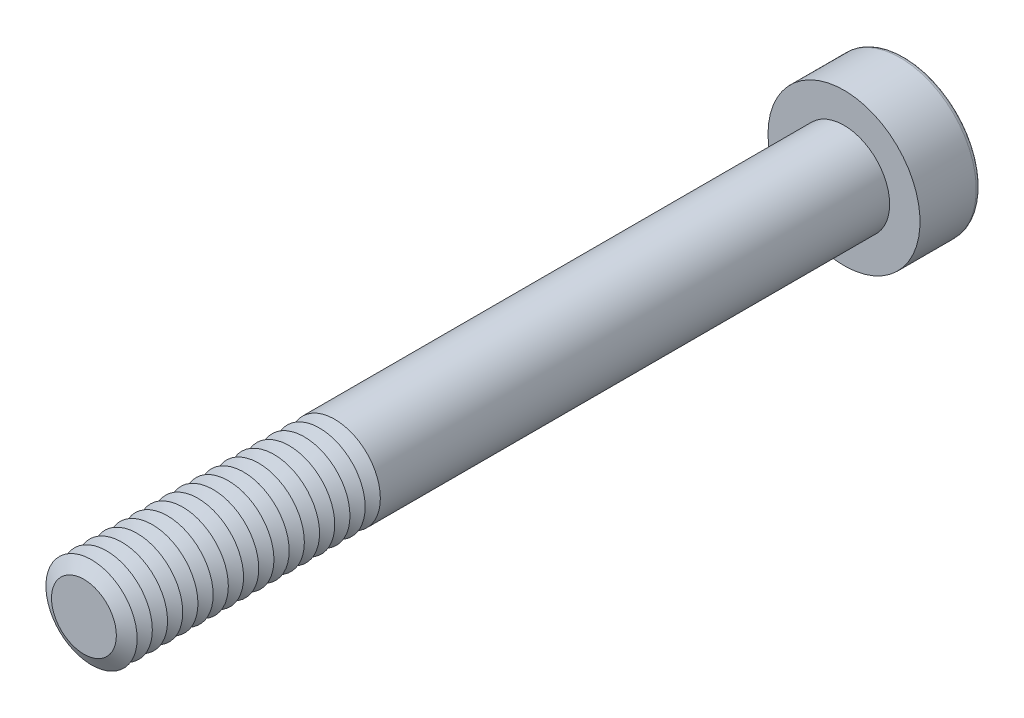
ISO-10303-21;
HEADER;
FILE_DESCRIPTION(('STEP AP214'),'2;1');
FILE_NAME('part.step','',(''),(''),'','','');
FILE_SCHEMA(('AUTOMOTIVE_DESIGN { 1 0 10303 214 1 1 1 1 }'));
ENDSEC;
DATA;
#1=APPLICATION_CONTEXT('core data for automotive mechanical design processes');
#2=APPLICATION_PROTOCOL_DEFINITION('international standard','automotive_design',2000,#1);
#3=PRODUCT_CONTEXT('',#1,'mechanical');
#4=PRODUCT('Part','Part','',(#3));
#5=PRODUCT_RELATED_PRODUCT_CATEGORY('part','',(#4));
#6=PRODUCT_DEFINITION_FORMATION('','',#4);
#7=PRODUCT_DEFINITION_CONTEXT('part definition',#1,'design');
#8=PRODUCT_DEFINITION('design','',#6,#7);
#9=PRODUCT_DEFINITION_SHAPE('','',#8);
#10=(LENGTH_UNIT() NAMED_UNIT(*) SI_UNIT(.MILLI.,.METRE.));
#11=(NAMED_UNIT(*) PLANE_ANGLE_UNIT() SI_UNIT($,.RADIAN.));
#12=(NAMED_UNIT(*) SI_UNIT($,.STERADIAN.) SOLID_ANGLE_UNIT());
#13=UNCERTAINTY_MEASURE_WITH_UNIT(LENGTH_MEASURE(1.E-05),#10,'distance_accuracy_value','');
#14=(GEOMETRIC_REPRESENTATION_CONTEXT(3) GLOBAL_UNCERTAINTY_ASSIGNED_CONTEXT((#13)) GLOBAL_UNIT_ASSIGNED_CONTEXT((#10,
#11,#12)) REPRESENTATION_CONTEXT('',''));
#15=CARTESIAN_POINT('',(0.,0.,0.));
#16=DIRECTION('',(0.,0.,1.));
#17=DIRECTION('',(1.,0.,0.));
#18=AXIS2_PLACEMENT_3D('',#15,#16,#17);
#19=CARTESIAN_POINT('',(0.,0.,46.5));
#20=DIRECTION('',(0.,0.,1.));
#21=DIRECTION('',(1.,0.,0.));
#22=AXIS2_PLACEMENT_3D('',#19,#20,#21);
#23=CONICAL_SURFACE('',#22,3.,1.0471975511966);
#24=CARTESIAN_POINT('',(0.,0.,46.));
#25=DIRECTION('',(0.,0.,1.));
#26=DIRECTION('',(1.,0.,0.));
#27=AXIS2_PLACEMENT_3D('',#24,#25,#26);
#28=CIRCLE('',#27,2.13397459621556);
#29=CARTESIAN_POINT('',(2.13397459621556,0.,46.));
#30=VERTEX_POINT('',#29);
#31=EDGE_CURVE('E314',#30,#30,#28,.T.);
#32=ORIENTED_EDGE('',*,*,#31,.T.);
#33=EDGE_LOOP('',(#32));
#34=FACE_BOUND('',#33,.T.);
#35=CARTESIAN_POINT('',(0.,0.,46.5));
#36=DIRECTION('',(0.,0.,1.));
#37=DIRECTION('',(1.,0.,0.));
#38=AXIS2_PLACEMENT_3D('',#35,#36,#37);
#39=CIRCLE('',#38,3.);
#40=CARTESIAN_POINT('',(3.,0.,46.5));
#41=VERTEX_POINT('',#40);
#42=EDGE_CURVE('E317',#41,#41,#39,.T.);
#43=ORIENTED_EDGE('',*,*,#42,.F.);
#44=EDGE_LOOP('',(#43));
#45=FACE_BOUND('',#44,.T.);
#46=ADVANCED_FACE('F39',(#34,#45),#23,.T.);
#47=CARTESIAN_POINT('',(0.,0.,46.));
#48=DIRECTION('',(0.,0.,-1.));
#49=DIRECTION('',(-1.,0.,0.));
#50=AXIS2_PLACEMENT_3D('',#47,#48,#49);
#51=CONICAL_SURFACE('',#50,2.13397459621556,1.0471975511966);
#52=CARTESIAN_POINT('',(0.,0.,45.5));
#53=DIRECTION('',(0.,0.,1.));
#54=DIRECTION('',(1.,0.,0.));
#55=AXIS2_PLACEMENT_3D('',#52,#53,#54);
#56=CIRCLE('',#55,3.);
#57=CARTESIAN_POINT('',(3.,0.,45.5));
#58=VERTEX_POINT('',#57);
#59=EDGE_CURVE('E325',#58,#58,#56,.T.);
#60=ORIENTED_EDGE('',*,*,#59,.T.);
#61=EDGE_LOOP('',(#60));
#62=FACE_BOUND('',#61,.T.);
#63=ORIENTED_EDGE('',*,*,#31,.F.);
#64=EDGE_LOOP('',(#63));
#65=FACE_BOUND('',#64,.T.);
#66=ADVANCED_FACE('F245',(#62,#65),#51,.T.);
#67=CARTESIAN_POINT('',(0.,0.,50.));
#68=DIRECTION('',(0.,0.,1.));
#69=DIRECTION('',(1.,0.,0.));
#70=AXIS2_PLACEMENT_3D('',#67,#68,#69);
#71=PLANE('',#70);
#72=CARTESIAN_POINT('',(0.,0.,50.));
#73=DIRECTION('',(0.,0.,1.));
#74=DIRECTION('',(1.,0.,0.));
#75=AXIS2_PLACEMENT_3D('',#72,#73,#74);
#76=CIRCLE('',#75,2.13397459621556);
#77=CARTESIAN_POINT('',(2.13397459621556,0.,50.));
#78=VERTEX_POINT('',#77);
#79=EDGE_CURVE('E174',#78,#78,#76,.T.);
#80=ORIENTED_EDGE('',*,*,#79,.T.);
#81=EDGE_LOOP('',(#80));
#82=FACE_BOUND('',#81,.T.);
#83=ADVANCED_FACE('F251',(#82),#71,.T.);
#84=CARTESIAN_POINT('',(0.,0.,50.));
#85=DIRECTION('',(0.,0.,-1.));
#86=DIRECTION('',(-1.,0.,0.));
#87=AXIS2_PLACEMENT_3D('',#84,#85,#86);
#88=CONICAL_SURFACE('',#87,2.13397459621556,1.0471975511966);
#89=CARTESIAN_POINT('',(0.,0.,49.5));
#90=DIRECTION('',(0.,0.,1.));
#91=DIRECTION('',(1.,0.,0.));
#92=AXIS2_PLACEMENT_3D('',#89,#90,#91);
#93=CIRCLE('',#92,3.);
#94=CARTESIAN_POINT('',(3.,0.,49.5));
#95=VERTEX_POINT('',#94);
#96=EDGE_CURVE('E291',#95,#95,#93,.T.);
#97=ORIENTED_EDGE('',*,*,#96,.T.);
#98=EDGE_LOOP('',(#97));
#99=FACE_BOUND('',#98,.T.);
#100=ORIENTED_EDGE('',*,*,#79,.F.);
#101=EDGE_LOOP('',(#100));
#102=FACE_BOUND('',#101,.T.);
#103=ADVANCED_FACE('F199',(#99,#102),#88,.T.);
#104=CARTESIAN_POINT('',(0.,0.,49.5));
#105=DIRECTION('',(0.,0.,1.));
#106=DIRECTION('',(1.,0.,0.));
#107=AXIS2_PLACEMENT_3D('',#104,#105,#106);
#108=CONICAL_SURFACE('',#107,3.,1.0471975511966);
#109=CARTESIAN_POINT('',(0.,0.,49.));
#110=DIRECTION('',(0.,0.,1.));
#111=DIRECTION('',(1.,0.,0.));
#112=AXIS2_PLACEMENT_3D('',#109,#110,#111);
#113=CIRCLE('',#112,2.13397459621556);
#114=CARTESIAN_POINT('',(2.13397459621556,0.,49.));
#115=VERTEX_POINT('',#114);
#116=EDGE_CURVE('E288',#115,#115,#113,.T.);
#117=ORIENTED_EDGE('',*,*,#116,.T.);
#118=EDGE_LOOP('',(#117));
#119=FACE_BOUND('',#118,.T.);
#120=ORIENTED_EDGE('',*,*,#96,.F.);
#121=EDGE_LOOP('',(#120));
#122=FACE_BOUND('',#121,.T.);
#123=ADVANCED_FACE('F277',(#119,#122),#108,.T.);
#124=CARTESIAN_POINT('',(0.,0.,49.));
#125=DIRECTION('',(0.,0.,-1.));
#126=DIRECTION('',(-1.,0.,0.));
#127=AXIS2_PLACEMENT_3D('',#124,#125,#126);
#128=CONICAL_SURFACE('',#127,2.13397459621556,1.0471975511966);
#129=CARTESIAN_POINT('',(0.,0.,48.5));
#130=DIRECTION('',(0.,0.,1.));
#131=DIRECTION('',(1.,0.,0.));
#132=AXIS2_PLACEMENT_3D('',#129,#130,#131);
#133=CIRCLE('',#132,3.);
#134=CARTESIAN_POINT('',(3.,0.,48.5));
#135=VERTEX_POINT('',#134);
#136=EDGE_CURVE('E300',#135,#135,#133,.T.);
#137=ORIENTED_EDGE('',*,*,#136,.T.);
#138=EDGE_LOOP('',(#137));
#139=FACE_BOUND('',#138,.T.);
#140=ORIENTED_EDGE('',*,*,#116,.F.);
#141=EDGE_LOOP('',(#140));
#142=FACE_BOUND('',#141,.T.);
#143=ADVANCED_FACE('F274',(#139,#142),#128,.T.);
#144=CARTESIAN_POINT('',(0.,0.,48.5));
#145=DIRECTION('',(0.,0.,1.));
#146=DIRECTION('',(1.,0.,0.));
#147=AXIS2_PLACEMENT_3D('',#144,#145,#146);
#148=CONICAL_SURFACE('',#147,3.,1.0471975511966);
#149=CARTESIAN_POINT('',(0.,0.,48.));
#150=DIRECTION('',(0.,0.,1.));
#151=DIRECTION('',(1.,0.,0.));
#152=AXIS2_PLACEMENT_3D('',#149,#150,#151);
#153=CIRCLE('',#152,2.13397459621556);
#154=CARTESIAN_POINT('',(2.13397459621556,0.,48.));
#155=VERTEX_POINT('',#154);
#156=EDGE_CURVE('E293',#155,#155,#153,.T.);
#157=ORIENTED_EDGE('',*,*,#156,.T.);
#158=EDGE_LOOP('',(#157));
#159=FACE_BOUND('',#158,.T.);
#160=ORIENTED_EDGE('',*,*,#136,.F.);
#161=EDGE_LOOP('',(#160));
#162=FACE_BOUND('',#161,.T.);
#163=ADVANCED_FACE('F270',(#159,#162),#148,.T.);
#164=CARTESIAN_POINT('',(0.,0.,48.));
#165=DIRECTION('',(0.,0.,-1.));
#166=DIRECTION('',(-1.,0.,0.));
#167=AXIS2_PLACEMENT_3D('',#164,#165,#166);
#168=CONICAL_SURFACE('',#167,2.13397459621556,1.0471975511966);
#169=CARTESIAN_POINT('',(0.,0.,47.5));
#170=DIRECTION('',(0.,0.,1.));
#171=DIRECTION('',(1.,0.,0.));
#172=AXIS2_PLACEMENT_3D('',#169,#170,#171);
#173=CIRCLE('',#172,3.);
#174=CARTESIAN_POINT('',(3.,0.,47.5));
#175=VERTEX_POINT('',#174);
#176=EDGE_CURVE('E310',#175,#175,#173,.T.);
#177=ORIENTED_EDGE('',*,*,#176,.T.);
#178=EDGE_LOOP('',(#177));
#179=FACE_BOUND('',#178,.T.);
#180=ORIENTED_EDGE('',*,*,#156,.F.);
#181=EDGE_LOOP('',(#180));
#182=FACE_BOUND('',#181,.T.);
#183=ADVANCED_FACE('F266',(#179,#182),#168,.T.);
#184=CARTESIAN_POINT('',(0.,0.,47.5));
#185=DIRECTION('',(0.,0.,1.));
#186=DIRECTION('',(1.,0.,0.));
#187=AXIS2_PLACEMENT_3D('',#184,#185,#186);
#188=CONICAL_SURFACE('',#187,3.,1.0471975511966);
#189=CARTESIAN_POINT('',(0.,0.,47.));
#190=DIRECTION('',(0.,0.,1.));
#191=DIRECTION('',(1.,0.,0.));
#192=AXIS2_PLACEMENT_3D('',#189,#190,#191);
#193=CIRCLE('',#192,2.13397459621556);
#194=CARTESIAN_POINT('',(2.13397459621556,0.,47.));
#195=VERTEX_POINT('',#194);
#196=EDGE_CURVE('E306',#195,#195,#193,.T.);
#197=ORIENTED_EDGE('',*,*,#196,.T.);
#198=EDGE_LOOP('',(#197));
#199=FACE_BOUND('',#198,.T.);
#200=ORIENTED_EDGE('',*,*,#176,.F.);
#201=EDGE_LOOP('',(#200));
#202=FACE_BOUND('',#201,.T.);
#203=ADVANCED_FACE('F262',(#199,#202),#188,.T.);
#204=CARTESIAN_POINT('',(0.,0.,47.));
#205=DIRECTION('',(0.,0.,-1.));
#206=DIRECTION('',(-1.,0.,0.));
#207=AXIS2_PLACEMENT_3D('',#204,#205,#206);
#208=CONICAL_SURFACE('',#207,2.13397459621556,1.0471975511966);
#209=ORIENTED_EDGE('',*,*,#42,.T.);
#210=EDGE_LOOP('',(#209));
#211=FACE_BOUND('',#210,.T.);
#212=ORIENTED_EDGE('',*,*,#196,.F.);
#213=EDGE_LOOP('',(#212));
#214=FACE_BOUND('',#213,.T.);
#215=ADVANCED_FACE('F258',(#211,#214),#208,.T.);
#216=CARTESIAN_POINT('',(0.,0.,45.5));
#217=DIRECTION('',(0.,0.,1.));
#218=DIRECTION('',(1.,0.,0.));
#219=AXIS2_PLACEMENT_3D('',#216,#217,#218);
#220=CONICAL_SURFACE('',#219,3.,1.0471975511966);
#221=CARTESIAN_POINT('',(0.,0.,45.));
#222=DIRECTION('',(0.,0.,1.));
#223=DIRECTION('',(1.,0.,0.));
#224=AXIS2_PLACEMENT_3D('',#221,#222,#223);
#225=CIRCLE('',#224,2.13397459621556);
#226=CARTESIAN_POINT('',(2.13397459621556,0.,45.));
#227=VERTEX_POINT('',#226);
#228=EDGE_CURVE('E321',#227,#227,#225,.T.);
#229=ORIENTED_EDGE('',*,*,#228,.T.);
#230=EDGE_LOOP('',(#229));
#231=FACE_BOUND('',#230,.T.);
#232=ORIENTED_EDGE('',*,*,#59,.F.);
#233=EDGE_LOOP('',(#232));
#234=FACE_BOUND('',#233,.T.);
#235=ADVANCED_FACE('F261',(#231,#234),#220,.T.);
#236=CARTESIAN_POINT('',(0.,0.,45.));
#237=DIRECTION('',(0.,0.,-1.));
#238=DIRECTION('',(-1.,0.,0.));
#239=AXIS2_PLACEMENT_3D('',#236,#237,#238);
#240=CONICAL_SURFACE('',#239,2.13397459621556,1.0471975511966);
#241=CARTESIAN_POINT('',(0.,0.,44.5));
#242=DIRECTION('',(0.,0.,1.));
#243=DIRECTION('',(1.,0.,0.));
#244=AXIS2_PLACEMENT_3D('',#241,#242,#243);
#245=CIRCLE('',#244,3.);
#246=CARTESIAN_POINT('',(3.,0.,44.5));
#247=VERTEX_POINT('',#246);
#248=EDGE_CURVE('E332',#247,#247,#245,.T.);
#249=ORIENTED_EDGE('',*,*,#248,.T.);
#250=EDGE_LOOP('',(#249));
#251=FACE_BOUND('',#250,.T.);
#252=ORIENTED_EDGE('',*,*,#228,.F.);
#253=EDGE_LOOP('',(#252));
#254=FACE_BOUND('',#253,.T.);
#255=ADVANCED_FACE('F511',(#251,#254),#240,.T.);
#256=CARTESIAN_POINT('',(0.,0.,44.5));
#257=DIRECTION('',(0.,0.,1.));
#258=DIRECTION('',(1.,0.,0.));
#259=AXIS2_PLACEMENT_3D('',#256,#257,#258);
#260=CONICAL_SURFACE('',#259,3.,1.0471975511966);
#261=CARTESIAN_POINT('',(0.,0.,44.));
#262=DIRECTION('',(0.,0.,1.));
#263=DIRECTION('',(1.,0.,0.));
#264=AXIS2_PLACEMENT_3D('',#261,#262,#263);
#265=CIRCLE('',#264,2.13397459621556);
#266=CARTESIAN_POINT('',(2.13397459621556,0.,44.));
#267=VERTEX_POINT('',#266);
#268=EDGE_CURVE('E329',#267,#267,#265,.T.);
#269=ORIENTED_EDGE('',*,*,#268,.T.);
#270=EDGE_LOOP('',(#269));
#271=FACE_BOUND('',#270,.T.);
#272=ORIENTED_EDGE('',*,*,#248,.F.);
#273=EDGE_LOOP('',(#272));
#274=FACE_BOUND('',#273,.T.);
#275=ADVANCED_FACE('F507',(#271,#274),#260,.T.);
#276=CARTESIAN_POINT('',(0.,0.,44.));
#277=DIRECTION('',(0.,0.,-1.));
#278=DIRECTION('',(-1.,0.,0.));
#279=AXIS2_PLACEMENT_3D('',#276,#277,#278);
#280=CONICAL_SURFACE('',#279,2.13397459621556,1.0471975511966);
#281=CARTESIAN_POINT('',(0.,0.,43.5));
#282=DIRECTION('',(0.,0.,1.));
#283=DIRECTION('',(1.,0.,0.));
#284=AXIS2_PLACEMENT_3D('',#281,#282,#283);
#285=CIRCLE('',#284,3.);
#286=CARTESIAN_POINT('',(3.,0.,43.5));
#287=VERTEX_POINT('',#286);
#288=EDGE_CURVE('E340',#287,#287,#285,.T.);
#289=ORIENTED_EDGE('',*,*,#288,.T.);
#290=EDGE_LOOP('',(#289));
#291=FACE_BOUND('',#290,.T.);
#292=ORIENTED_EDGE('',*,*,#268,.F.);
#293=EDGE_LOOP('',(#292));
#294=FACE_BOUND('',#293,.T.);
#295=ADVANCED_FACE('F503',(#291,#294),#280,.T.);
#296=CARTESIAN_POINT('',(0.,0.,43.5));
#297=DIRECTION('',(0.,0.,1.));
#298=DIRECTION('',(1.,0.,0.));
#299=AXIS2_PLACEMENT_3D('',#296,#297,#298);
#300=CONICAL_SURFACE('',#299,3.,1.0471975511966);
#301=CARTESIAN_POINT('',(0.,0.,43.));
#302=DIRECTION('',(0.,0.,1.));
#303=DIRECTION('',(1.,0.,0.));
#304=AXIS2_PLACEMENT_3D('',#301,#302,#303);
#305=CIRCLE('',#304,2.13397459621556);
#306=CARTESIAN_POINT('',(2.13397459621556,0.,43.));
#307=VERTEX_POINT('',#306);
#308=EDGE_CURVE('E336',#307,#307,#305,.T.);
#309=ORIENTED_EDGE('',*,*,#308,.T.);
#310=EDGE_LOOP('',(#309));
#311=FACE_BOUND('',#310,.T.);
#312=ORIENTED_EDGE('',*,*,#288,.F.);
#313=EDGE_LOOP('',(#312));
#314=FACE_BOUND('',#313,.T.);
#315=ADVANCED_FACE('F499',(#311,#314),#300,.T.);
#316=CARTESIAN_POINT('',(0.,0.,43.));
#317=DIRECTION('',(0.,0.,-1.));
#318=DIRECTION('',(-1.,0.,0.));
#319=AXIS2_PLACEMENT_3D('',#316,#317,#318);
#320=CONICAL_SURFACE('',#319,2.13397459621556,1.0471975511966);
#321=CARTESIAN_POINT('',(0.,0.,42.5));
#322=DIRECTION('',(0.,0.,1.));
#323=DIRECTION('',(1.,0.,0.));
#324=AXIS2_PLACEMENT_3D('',#321,#322,#323);
#325=CIRCLE('',#324,3.);
#326=CARTESIAN_POINT('',(3.,0.,42.5));
#327=VERTEX_POINT('',#326);
#328=EDGE_CURVE('E348',#327,#327,#325,.T.);
#329=ORIENTED_EDGE('',*,*,#328,.T.);
#330=EDGE_LOOP('',(#329));
#331=FACE_BOUND('',#330,.T.);
#332=ORIENTED_EDGE('',*,*,#308,.F.);
#333=EDGE_LOOP('',(#332));
#334=FACE_BOUND('',#333,.T.);
#335=ADVANCED_FACE('F495',(#331,#334),#320,.T.);
#336=CARTESIAN_POINT('',(0.,0.,42.5));
#337=DIRECTION('',(0.,0.,1.));
#338=DIRECTION('',(1.,0.,0.));
#339=AXIS2_PLACEMENT_3D('',#336,#337,#338);
#340=CONICAL_SURFACE('',#339,3.,1.0471975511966);
#341=CARTESIAN_POINT('',(0.,0.,42.));
#342=DIRECTION('',(0.,0.,1.));
#343=DIRECTION('',(1.,0.,0.));
#344=AXIS2_PLACEMENT_3D('',#341,#342,#343);
#345=CIRCLE('',#344,2.13397459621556);
#346=CARTESIAN_POINT('',(2.13397459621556,0.,42.));
#347=VERTEX_POINT('',#346);
#348=EDGE_CURVE('E344',#347,#347,#345,.T.);
#349=ORIENTED_EDGE('',*,*,#348,.T.);
#350=EDGE_LOOP('',(#349));
#351=FACE_BOUND('',#350,.T.);
#352=ORIENTED_EDGE('',*,*,#328,.F.);
#353=EDGE_LOOP('',(#352));
#354=FACE_BOUND('',#353,.T.);
#355=ADVANCED_FACE('F491',(#351,#354),#340,.T.);
#356=CARTESIAN_POINT('',(0.,0.,42.));
#357=DIRECTION('',(0.,0.,-1.));
#358=DIRECTION('',(-1.,0.,0.));
#359=AXIS2_PLACEMENT_3D('',#356,#357,#358);
#360=CONICAL_SURFACE('',#359,2.13397459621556,1.0471975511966);
#361=CARTESIAN_POINT('',(0.,0.,41.5));
#362=DIRECTION('',(0.,0.,1.));
#363=DIRECTION('',(1.,0.,0.));
#364=AXIS2_PLACEMENT_3D('',#361,#362,#363);
#365=CIRCLE('',#364,3.);
#366=CARTESIAN_POINT('',(3.,0.,41.5));
#367=VERTEX_POINT('',#366);
#368=EDGE_CURVE('E356',#367,#367,#365,.T.);
#369=ORIENTED_EDGE('',*,*,#368,.T.);
#370=EDGE_LOOP('',(#369));
#371=FACE_BOUND('',#370,.T.);
#372=ORIENTED_EDGE('',*,*,#348,.F.);
#373=EDGE_LOOP('',(#372));
#374=FACE_BOUND('',#373,.T.);
#375=ADVANCED_FACE('F487',(#371,#374),#360,.T.);
#376=CARTESIAN_POINT('',(0.,0.,41.5));
#377=DIRECTION('',(0.,0.,1.));
#378=DIRECTION('',(1.,0.,0.));
#379=AXIS2_PLACEMENT_3D('',#376,#377,#378);
#380=CONICAL_SURFACE('',#379,3.,1.0471975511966);
#381=CARTESIAN_POINT('',(0.,0.,41.));
#382=DIRECTION('',(0.,0.,1.));
#383=DIRECTION('',(1.,0.,0.));
#384=AXIS2_PLACEMENT_3D('',#381,#382,#383);
#385=CIRCLE('',#384,2.13397459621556);
#386=CARTESIAN_POINT('',(2.13397459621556,0.,41.));
#387=VERTEX_POINT('',#386);
#388=EDGE_CURVE('E352',#387,#387,#385,.T.);
#389=ORIENTED_EDGE('',*,*,#388,.T.);
#390=EDGE_LOOP('',(#389));
#391=FACE_BOUND('',#390,.T.);
#392=ORIENTED_EDGE('',*,*,#368,.F.);
#393=EDGE_LOOP('',(#392));
#394=FACE_BOUND('',#393,.T.);
#395=ADVANCED_FACE('F483',(#391,#394),#380,.T.);
#396=CARTESIAN_POINT('',(0.,0.,41.));
#397=DIRECTION('',(0.,0.,-1.));
#398=DIRECTION('',(-1.,0.,0.));
#399=AXIS2_PLACEMENT_3D('',#396,#397,#398);
#400=CONICAL_SURFACE('',#399,2.13397459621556,1.0471975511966);
#401=CARTESIAN_POINT('',(0.,0.,40.5));
#402=DIRECTION('',(0.,0.,1.));
#403=DIRECTION('',(1.,0.,0.));
#404=AXIS2_PLACEMENT_3D('',#401,#402,#403);
#405=CIRCLE('',#404,3.);
#406=CARTESIAN_POINT('',(3.,0.,40.5));
#407=VERTEX_POINT('',#406);
#408=EDGE_CURVE('E364',#407,#407,#405,.T.);
#409=ORIENTED_EDGE('',*,*,#408,.T.);
#410=EDGE_LOOP('',(#409));
#411=FACE_BOUND('',#410,.T.);
#412=ORIENTED_EDGE('',*,*,#388,.F.);
#413=EDGE_LOOP('',(#412));
#414=FACE_BOUND('',#413,.T.);
#415=ADVANCED_FACE('F479',(#411,#414),#400,.T.);
#416=CARTESIAN_POINT('',(0.,0.,40.5));
#417=DIRECTION('',(0.,0.,1.));
#418=DIRECTION('',(1.,0.,0.));
#419=AXIS2_PLACEMENT_3D('',#416,#417,#418);
#420=CONICAL_SURFACE('',#419,3.,1.0471975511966);
#421=CARTESIAN_POINT('',(0.,0.,40.));
#422=DIRECTION('',(0.,0.,1.));
#423=DIRECTION('',(1.,0.,0.));
#424=AXIS2_PLACEMENT_3D('',#421,#422,#423);
#425=CIRCLE('',#424,2.13397459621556);
#426=CARTESIAN_POINT('',(2.13397459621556,0.,40.));
#427=VERTEX_POINT('',#426);
#428=EDGE_CURVE('E360',#427,#427,#425,.T.);
#429=ORIENTED_EDGE('',*,*,#428,.T.);
#430=EDGE_LOOP('',(#429));
#431=FACE_BOUND('',#430,.T.);
#432=ORIENTED_EDGE('',*,*,#408,.F.);
#433=EDGE_LOOP('',(#432));
#434=FACE_BOUND('',#433,.T.);
#435=ADVANCED_FACE('F475',(#431,#434),#420,.T.);
#436=CARTESIAN_POINT('',(0.,0.,40.));
#437=DIRECTION('',(0.,0.,-1.));
#438=DIRECTION('',(-1.,0.,0.));
#439=AXIS2_PLACEMENT_3D('',#436,#437,#438);
#440=CONICAL_SURFACE('',#439,2.13397459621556,1.0471975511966);
#441=CARTESIAN_POINT('',(0.,0.,39.5));
#442=DIRECTION('',(0.,0.,1.));
#443=DIRECTION('',(1.,0.,0.));
#444=AXIS2_PLACEMENT_3D('',#441,#442,#443);
#445=CIRCLE('',#444,3.);
#446=CARTESIAN_POINT('',(3.,0.,39.5));
#447=VERTEX_POINT('',#446);
#448=EDGE_CURVE('E372',#447,#447,#445,.T.);
#449=ORIENTED_EDGE('',*,*,#448,.T.);
#450=EDGE_LOOP('',(#449));
#451=FACE_BOUND('',#450,.T.);
#452=ORIENTED_EDGE('',*,*,#428,.F.);
#453=EDGE_LOOP('',(#452));
#454=FACE_BOUND('',#453,.T.);
#455=ADVANCED_FACE('F471',(#451,#454),#440,.T.);
#456=CARTESIAN_POINT('',(0.,0.,39.5));
#457=DIRECTION('',(0.,0.,1.));
#458=DIRECTION('',(1.,0.,0.));
#459=AXIS2_PLACEMENT_3D('',#456,#457,#458);
#460=CONICAL_SURFACE('',#459,3.,1.0471975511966);
#461=CARTESIAN_POINT('',(0.,0.,39.));
#462=DIRECTION('',(0.,0.,1.));
#463=DIRECTION('',(1.,0.,0.));
#464=AXIS2_PLACEMENT_3D('',#461,#462,#463);
#465=CIRCLE('',#464,2.13397459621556);
#466=CARTESIAN_POINT('',(2.13397459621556,0.,39.));
#467=VERTEX_POINT('',#466);
#468=EDGE_CURVE('E368',#467,#467,#465,.T.);
#469=ORIENTED_EDGE('',*,*,#468,.T.);
#470=EDGE_LOOP('',(#469));
#471=FACE_BOUND('',#470,.T.);
#472=ORIENTED_EDGE('',*,*,#448,.F.);
#473=EDGE_LOOP('',(#472));
#474=FACE_BOUND('',#473,.T.);
#475=ADVANCED_FACE('F467',(#471,#474),#460,.T.);
#476=CARTESIAN_POINT('',(0.,0.,39.));
#477=DIRECTION('',(0.,0.,-1.));
#478=DIRECTION('',(-1.,0.,0.));
#479=AXIS2_PLACEMENT_3D('',#476,#477,#478);
#480=CONICAL_SURFACE('',#479,2.13397459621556,1.0471975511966);
#481=CARTESIAN_POINT('',(0.,0.,38.5));
#482=DIRECTION('',(0.,0.,1.));
#483=DIRECTION('',(1.,0.,0.));
#484=AXIS2_PLACEMENT_3D('',#481,#482,#483);
#485=CIRCLE('',#484,3.);
#486=CARTESIAN_POINT('',(3.,0.,38.5));
#487=VERTEX_POINT('',#486);
#488=EDGE_CURVE('E380',#487,#487,#485,.T.);
#489=ORIENTED_EDGE('',*,*,#488,.T.);
#490=EDGE_LOOP('',(#489));
#491=FACE_BOUND('',#490,.T.);
#492=ORIENTED_EDGE('',*,*,#468,.F.);
#493=EDGE_LOOP('',(#492));
#494=FACE_BOUND('',#493,.T.);
#495=ADVANCED_FACE('F463',(#491,#494),#480,.T.);
#496=CARTESIAN_POINT('',(0.,0.,38.5));
#497=DIRECTION('',(0.,0.,1.));
#498=DIRECTION('',(1.,0.,0.));
#499=AXIS2_PLACEMENT_3D('',#496,#497,#498);
#500=CONICAL_SURFACE('',#499,3.,1.0471975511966);
#501=CARTESIAN_POINT('',(0.,0.,38.));
#502=DIRECTION('',(0.,0.,1.));
#503=DIRECTION('',(1.,0.,0.));
#504=AXIS2_PLACEMENT_3D('',#501,#502,#503);
#505=CIRCLE('',#504,2.13397459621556);
#506=CARTESIAN_POINT('',(2.13397459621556,0.,38.));
#507=VERTEX_POINT('',#506);
#508=EDGE_CURVE('E376',#507,#507,#505,.T.);
#509=ORIENTED_EDGE('',*,*,#508,.T.);
#510=EDGE_LOOP('',(#509));
#511=FACE_BOUND('',#510,.T.);
#512=ORIENTED_EDGE('',*,*,#488,.F.);
#513=EDGE_LOOP('',(#512));
#514=FACE_BOUND('',#513,.T.);
#515=ADVANCED_FACE('F459',(#511,#514),#500,.T.);
#516=CARTESIAN_POINT('',(0.,0.,38.));
#517=DIRECTION('',(0.,0.,-1.));
#518=DIRECTION('',(-1.,0.,0.));
#519=AXIS2_PLACEMENT_3D('',#516,#517,#518);
#520=CONICAL_SURFACE('',#519,2.13397459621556,1.0471975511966);
#521=CARTESIAN_POINT('',(0.,0.,37.5));
#522=DIRECTION('',(0.,0.,1.));
#523=DIRECTION('',(1.,0.,0.));
#524=AXIS2_PLACEMENT_3D('',#521,#522,#523);
#525=CIRCLE('',#524,3.);
#526=CARTESIAN_POINT('',(3.,0.,37.5));
#527=VERTEX_POINT('',#526);
#528=EDGE_CURVE('E388',#527,#527,#525,.T.);
#529=ORIENTED_EDGE('',*,*,#528,.T.);
#530=EDGE_LOOP('',(#529));
#531=FACE_BOUND('',#530,.T.);
#532=ORIENTED_EDGE('',*,*,#508,.F.);
#533=EDGE_LOOP('',(#532));
#534=FACE_BOUND('',#533,.T.);
#535=ADVANCED_FACE('F455',(#531,#534),#520,.T.);
#536=CARTESIAN_POINT('',(0.,0.,37.5));
#537=DIRECTION('',(0.,0.,1.));
#538=DIRECTION('',(1.,0.,0.));
#539=AXIS2_PLACEMENT_3D('',#536,#537,#538);
#540=CONICAL_SURFACE('',#539,3.,1.0471975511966);
#541=CARTESIAN_POINT('',(0.,0.,37.));
#542=DIRECTION('',(0.,0.,1.));
#543=DIRECTION('',(1.,0.,0.));
#544=AXIS2_PLACEMENT_3D('',#541,#542,#543);
#545=CIRCLE('',#544,2.13397459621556);
#546=CARTESIAN_POINT('',(2.13397459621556,0.,37.));
#547=VERTEX_POINT('',#546);
#548=EDGE_CURVE('E384',#547,#547,#545,.T.);
#549=ORIENTED_EDGE('',*,*,#548,.T.);
#550=EDGE_LOOP('',(#549));
#551=FACE_BOUND('',#550,.T.);
#552=ORIENTED_EDGE('',*,*,#528,.F.);
#553=EDGE_LOOP('',(#552));
#554=FACE_BOUND('',#553,.T.);
#555=ADVANCED_FACE('F451',(#551,#554),#540,.T.);
#556=CARTESIAN_POINT('',(0.,0.,37.));
#557=DIRECTION('',(0.,0.,-1.));
#558=DIRECTION('',(-1.,0.,0.));
#559=AXIS2_PLACEMENT_3D('',#556,#557,#558);
#560=CONICAL_SURFACE('',#559,2.13397459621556,1.0471975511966);
#561=CARTESIAN_POINT('',(0.,0.,36.5));
#562=DIRECTION('',(0.,0.,1.));
#563=DIRECTION('',(1.,0.,0.));
#564=AXIS2_PLACEMENT_3D('',#561,#562,#563);
#565=CIRCLE('',#564,3.);
#566=CARTESIAN_POINT('',(3.,0.,36.5));
#567=VERTEX_POINT('',#566);
#568=EDGE_CURVE('E396',#567,#567,#565,.T.);
#569=ORIENTED_EDGE('',*,*,#568,.T.);
#570=EDGE_LOOP('',(#569));
#571=FACE_BOUND('',#570,.T.);
#572=ORIENTED_EDGE('',*,*,#548,.F.);
#573=EDGE_LOOP('',(#572));
#574=FACE_BOUND('',#573,.T.);
#575=ADVANCED_FACE('F447',(#571,#574),#560,.T.);
#576=CARTESIAN_POINT('',(0.,0.,36.5));
#577=DIRECTION('',(0.,0.,1.));
#578=DIRECTION('',(1.,0.,0.));
#579=AXIS2_PLACEMENT_3D('',#576,#577,#578);
#580=CONICAL_SURFACE('',#579,3.,1.0471975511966);
#581=CARTESIAN_POINT('',(0.,0.,36.));
#582=DIRECTION('',(0.,0.,1.));
#583=DIRECTION('',(1.,0.,0.));
#584=AXIS2_PLACEMENT_3D('',#581,#582,#583);
#585=CIRCLE('',#584,2.13397459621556);
#586=CARTESIAN_POINT('',(2.13397459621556,0.,36.));
#587=VERTEX_POINT('',#586);
#588=EDGE_CURVE('E392',#587,#587,#585,.T.);
#589=ORIENTED_EDGE('',*,*,#588,.T.);
#590=EDGE_LOOP('',(#589));
#591=FACE_BOUND('',#590,.T.);
#592=ORIENTED_EDGE('',*,*,#568,.F.);
#593=EDGE_LOOP('',(#592));
#594=FACE_BOUND('',#593,.T.);
#595=ADVANCED_FACE('F443',(#591,#594),#580,.T.);
#596=CARTESIAN_POINT('',(0.,0.,36.));
#597=DIRECTION('',(0.,0.,-1.));
#598=DIRECTION('',(-1.,0.,0.));
#599=AXIS2_PLACEMENT_3D('',#596,#597,#598);
#600=CONICAL_SURFACE('',#599,2.13397459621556,1.0471975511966);
#601=CARTESIAN_POINT('',(0.,0.,35.5));
#602=DIRECTION('',(0.,0.,1.));
#603=DIRECTION('',(1.,0.,0.));
#604=AXIS2_PLACEMENT_3D('',#601,#602,#603);
#605=CIRCLE('',#604,3.);
#606=CARTESIAN_POINT('',(3.,0.,35.5));
#607=VERTEX_POINT('',#606);
#608=EDGE_CURVE('E403',#607,#607,#605,.T.);
#609=ORIENTED_EDGE('',*,*,#608,.T.);
#610=EDGE_LOOP('',(#609));
#611=FACE_BOUND('',#610,.T.);
#612=ORIENTED_EDGE('',*,*,#588,.F.);
#613=EDGE_LOOP('',(#612));
#614=FACE_BOUND('',#613,.T.);
#615=ADVANCED_FACE('F439',(#611,#614),#600,.T.);
#616=CARTESIAN_POINT('',(0.,0.,35.5));
#617=DIRECTION('',(0.,0.,1.));
#618=DIRECTION('',(1.,0.,0.));
#619=AXIS2_PLACEMENT_3D('',#616,#617,#618);
#620=CONICAL_SURFACE('',#619,3.,1.0471975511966);
#621=CARTESIAN_POINT('',(0.,0.,35.));
#622=DIRECTION('',(0.,0.,1.));
#623=DIRECTION('',(1.,0.,0.));
#624=AXIS2_PLACEMENT_3D('',#621,#622,#623);
#625=CIRCLE('',#624,2.13397459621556);
#626=CARTESIAN_POINT('',(2.13397459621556,0.,35.));
#627=VERTEX_POINT('',#626);
#628=EDGE_CURVE('E399',#627,#627,#625,.T.);
#629=ORIENTED_EDGE('',*,*,#628,.T.);
#630=EDGE_LOOP('',(#629));
#631=FACE_BOUND('',#630,.T.);
#632=ORIENTED_EDGE('',*,*,#608,.F.);
#633=EDGE_LOOP('',(#632));
#634=FACE_BOUND('',#633,.T.);
#635=ADVANCED_FACE('F434',(#631,#634),#620,.T.);
#636=CARTESIAN_POINT('',(0.,0.,35.));
#637=DIRECTION('',(0.,0.,-1.));
#638=DIRECTION('',(-1.,0.,0.));
#639=AXIS2_PLACEMENT_3D('',#636,#637,#638);
#640=CONICAL_SURFACE('',#639,2.13397459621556,1.0471975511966);
#641=CARTESIAN_POINT('',(0.,0.,34.5));
#642=DIRECTION('',(0.,0.,1.));
#643=DIRECTION('',(1.,0.,0.));
#644=AXIS2_PLACEMENT_3D('',#641,#642,#643);
#645=CIRCLE('',#644,3.);
#646=CARTESIAN_POINT('',(3.,0.,34.5));
#647=VERTEX_POINT('',#646);
#648=EDGE_CURVE('E415',#647,#647,#645,.T.);
#649=ORIENTED_EDGE('',*,*,#648,.T.);
#650=EDGE_LOOP('',(#649));
#651=FACE_BOUND('',#650,.T.);
#652=ORIENTED_EDGE('',*,*,#628,.F.);
#653=EDGE_LOOP('',(#652));
#654=FACE_BOUND('',#653,.T.);
#655=ADVANCED_FACE('F420',(#651,#654),#640,.T.);
#656=CARTESIAN_POINT('',(0.,0.,34.5));
#657=DIRECTION('',(0.,0.,1.));
#658=DIRECTION('',(1.,0.,0.));
#659=AXIS2_PLACEMENT_3D('',#656,#657,#658);
#660=CONICAL_SURFACE('',#659,3.,1.0471975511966);
#661=CARTESIAN_POINT('',(0.,0.,34.));
#662=DIRECTION('',(0.,0.,1.));
#663=DIRECTION('',(1.,0.,0.));
#664=AXIS2_PLACEMENT_3D('',#661,#662,#663);
#665=CIRCLE('',#664,2.13397459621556);
#666=CARTESIAN_POINT('',(2.13397459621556,0.,34.));
#667=VERTEX_POINT('',#666);
#668=EDGE_CURVE('E407',#667,#667,#665,.T.);
#669=ORIENTED_EDGE('',*,*,#668,.T.);
#670=EDGE_LOOP('',(#669));
#671=FACE_BOUND('',#670,.T.);
#672=ORIENTED_EDGE('',*,*,#648,.F.);
#673=EDGE_LOOP('',(#672));
#674=FACE_BOUND('',#673,.T.);
#675=ADVANCED_FACE('F423',(#671,#674),#660,.T.);
#676=CARTESIAN_POINT('',(0.,0.,34.));
#677=DIRECTION('',(0.,0.,-1.));
#678=DIRECTION('',(-1.,0.,0.));
#679=AXIS2_PLACEMENT_3D('',#676,#677,#678);
#680=CONICAL_SURFACE('',#679,2.13397459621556,1.0471975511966);
#681=CARTESIAN_POINT('',(0.,0.,33.5));
#682=DIRECTION('',(0.,0.,1.));
#683=DIRECTION('',(1.,0.,0.));
#684=AXIS2_PLACEMENT_3D('',#681,#682,#683);
#685=CIRCLE('',#684,3.);
#686=CARTESIAN_POINT('',(3.,0.,33.5));
#687=VERTEX_POINT('',#686);
#688=EDGE_CURVE('E411',#687,#687,#685,.T.);
#689=ORIENTED_EDGE('',*,*,#688,.T.);
#690=EDGE_LOOP('',(#689));
#691=FACE_BOUND('',#690,.T.);
#692=ORIENTED_EDGE('',*,*,#668,.F.);
#693=EDGE_LOOP('',(#692));
#694=FACE_BOUND('',#693,.T.);
#695=ADVANCED_FACE('F425',(#691,#694),#680,.T.);
#696=CARTESIAN_POINT('',(0.,0.,-1.));
#697=DIRECTION('',(0.,0.,-1.));
#698=DIRECTION('',(-1.,0.,0.));
#699=AXIS2_PLACEMENT_3D('',#696,#697,#698);
#700=CONICAL_SURFACE('',#699,2.,1.0471975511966);
#701=CARTESIAN_POINT('',(0.,0.,0.154700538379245));
#702=VERTEX_POINT('',#701);
#703=VERTEX_LOOP('',#702);
#704=FACE_BOUND('',#703,.T.);
#705=CARTESIAN_POINT('',(0.,0.,-1.));
#706=DIRECTION('',(0.,0.,-1.));
#707=DIRECTION('',(-1.,0.,0.));
#708=AXIS2_PLACEMENT_3D('',#705,#706,#707);
#709=CIRCLE('',#708,2.);
#710=CARTESIAN_POINT('',(-1.73205080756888,0.999999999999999,-1.));
#711=VERTEX_POINT('',#710);
#712=CARTESIAN_POINT('',(0.,2.,-1.));
#713=VERTEX_POINT('',#712);
#714=EDGE_CURVE('E149',#711,#713,#709,.T.);
#715=ORIENTED_EDGE('',*,*,#714,.T.);
#716=CARTESIAN_POINT('',(0.,0.,-1.));
#717=DIRECTION('',(0.,0.,-1.));
#718=DIRECTION('',(-1.,0.,0.));
#719=AXIS2_PLACEMENT_3D('',#716,#717,#718);
#720=CIRCLE('',#719,2.);
#721=CARTESIAN_POINT('',(1.73205080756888,1.,-1.));
#722=VERTEX_POINT('',#721);
#723=EDGE_CURVE('E54',#713,#722,#720,.T.);
#724=ORIENTED_EDGE('',*,*,#723,.T.);
#725=CARTESIAN_POINT('',(1.73205080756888,-0.999999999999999,-1.));
#726=VERTEX_POINT('',#725);
#727=EDGE_CURVE('E1028',#722,#726,#720,.T.);
#728=ORIENTED_EDGE('',*,*,#727,.T.);
#729=CARTESIAN_POINT('',(0.,-2.,-1.));
#730=VERTEX_POINT('',#729);
#731=EDGE_CURVE('E1027',#726,#730,#720,.T.);
#732=ORIENTED_EDGE('',*,*,#731,.T.);
#733=CARTESIAN_POINT('',(-1.73205080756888,-0.999999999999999,-1.));
#734=VERTEX_POINT('',#733);
#735=EDGE_CURVE('E1021',#730,#734,#720,.T.);
#736=ORIENTED_EDGE('',*,*,#735,.T.);
#737=EDGE_CURVE('E1019',#734,#711,#720,.T.);
#738=ORIENTED_EDGE('',*,*,#737,.T.);
#739=EDGE_LOOP('',(#715,#724,#728,#732,#736,#738));
#740=FACE_BOUND('',#739,.T.);
#741=ADVANCED_FACE('F201',(#704,#740),#700,.F.);
#742=CARTESIAN_POINT('',(0.,0.,-1.));
#743=DIRECTION('',(0.,0.,-1.));
#744=DIRECTION('',(-1.,0.,0.));
#745=AXIS2_PLACEMENT_3D('',#742,#743,#744);
#746=PLANE('',#745);
#747=ORIENTED_EDGE('',*,*,#723,.F.);
#748=DIRECTION('',(1.,0.,0.));
#749=VECTOR('',#748,1.);
#750=CARTESIAN_POINT('',(-1.15470053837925,2.,-1.));
#751=LINE('',#750,#749);
#752=CARTESIAN_POINT('',(1.15470053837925,2.,-1.));
#753=VERTEX_POINT('',#752);
#754=EDGE_CURVE('E1065',#713,#753,#751,.T.);
#755=ORIENTED_EDGE('',*,*,#754,.T.);
#756=DIRECTION('',(0.5,-0.866025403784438,0.));
#757=VECTOR('',#756,1.);
#758=CARTESIAN_POINT('',(1.15470053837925,2.,-1.));
#759=LINE('',#758,#757);
#760=EDGE_CURVE('E155',#753,#722,#759,.T.);
#761=ORIENTED_EDGE('',*,*,#760,.T.);
#762=EDGE_LOOP('',(#747,#755,#761));
#763=FACE_BOUND('',#762,.T.);
#764=ADVANCED_FACE('F606',(#763),#746,.T.);
#765=ORIENTED_EDGE('',*,*,#727,.F.);
#766=CARTESIAN_POINT('',(2.3094010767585,0.,-1.));
#767=VERTEX_POINT('',#766);
#768=EDGE_CURVE('E1069',#722,#767,#759,.T.);
#769=ORIENTED_EDGE('',*,*,#768,.T.);
#770=DIRECTION('',(-0.5,-0.866025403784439,0.));
#771=VECTOR('',#770,1.);
#772=CARTESIAN_POINT('',(2.3094010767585,0.,-1.));
#773=LINE('',#772,#771);
#774=EDGE_CURVE('E1039',#767,#726,#773,.T.);
#775=ORIENTED_EDGE('',*,*,#774,.T.);
#776=EDGE_LOOP('',(#765,#769,#775));
#777=FACE_BOUND('',#776,.T.);
#778=ADVANCED_FACE('F616',(#777),#746,.T.);
#779=ORIENTED_EDGE('',*,*,#731,.F.);
#780=CARTESIAN_POINT('',(1.15470053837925,-2.,-1.));
#781=VERTEX_POINT('',#780);
#782=EDGE_CURVE('E1041',#726,#781,#773,.T.);
#783=ORIENTED_EDGE('',*,*,#782,.T.);
#784=DIRECTION('',(-1.,0.,0.));
#785=VECTOR('',#784,1.);
#786=CARTESIAN_POINT('',(1.15470053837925,-2.,-1.));
#787=LINE('',#786,#785);
#788=EDGE_CURVE('E993',#781,#730,#787,.T.);
#789=ORIENTED_EDGE('',*,*,#788,.T.);
#790=EDGE_LOOP('',(#779,#783,#789));
#791=FACE_BOUND('',#790,.T.);
#792=ADVANCED_FACE('F626',(#791),#746,.T.);
#793=ORIENTED_EDGE('',*,*,#735,.F.);
#794=CARTESIAN_POINT('',(-1.15470053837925,-2.,-1.));
#795=VERTEX_POINT('',#794);
#796=EDGE_CURVE('E1035',#730,#795,#787,.T.);
#797=ORIENTED_EDGE('',*,*,#796,.T.);
#798=DIRECTION('',(-0.5,0.866025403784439,0.));
#799=VECTOR('',#798,1.);
#800=CARTESIAN_POINT('',(-1.15470053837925,-2.,-1.));
#801=LINE('',#800,#799);
#802=EDGE_CURVE('E1037',#795,#734,#801,.T.);
#803=ORIENTED_EDGE('',*,*,#802,.T.);
#804=EDGE_LOOP('',(#793,#797,#803));
#805=FACE_BOUND('',#804,.T.);
#806=ADVANCED_FACE('F634',(#805),#746,.T.);
#807=ORIENTED_EDGE('',*,*,#737,.F.);
#808=CARTESIAN_POINT('',(-2.3094010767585,0.,-1.));
#809=VERTEX_POINT('',#808);
#810=EDGE_CURVE('E1043',#734,#809,#801,.T.);
#811=ORIENTED_EDGE('',*,*,#810,.T.);
#812=DIRECTION('',(0.5,0.866025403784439,0.));
#813=VECTOR('',#812,1.);
#814=CARTESIAN_POINT('',(-2.3094010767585,0.,-1.));
#815=LINE('',#814,#813);
#816=EDGE_CURVE('E158',#809,#711,#815,.T.);
#817=ORIENTED_EDGE('',*,*,#816,.T.);
#818=EDGE_LOOP('',(#807,#811,#817));
#819=FACE_BOUND('',#818,.T.);
#820=ADVANCED_FACE('F231',(#819),#746,.T.);
#821=ORIENTED_EDGE('',*,*,#714,.F.);
#822=CARTESIAN_POINT('',(-1.15470053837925,2.,-1.));
#823=VERTEX_POINT('',#822);
#824=EDGE_CURVE('E1049',#711,#823,#815,.T.);
#825=ORIENTED_EDGE('',*,*,#824,.T.);
#826=EDGE_CURVE('E1063',#823,#713,#751,.T.);
#827=ORIENTED_EDGE('',*,*,#826,.T.);
#828=EDGE_LOOP('',(#821,#825,#827));
#829=FACE_BOUND('',#828,.T.);
#830=ADVANCED_FACE('F618',(#829),#746,.T.);
#831=CARTESIAN_POINT('',(-1.15470053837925,2.,-1.));
#832=DIRECTION('',(0.,1.,0.));
#833=DIRECTION('',(0.,0.,1.));
#834=AXIS2_PLACEMENT_3D('',#831,#832,#833);
#835=PLANE('',#834);
#836=DIRECTION('',(0.,0.,-1.));
#837=VECTOR('',#836,1.);
#838=CARTESIAN_POINT('',(-1.15470053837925,2.,-1.));
#839=LINE('',#838,#837);
#840=CARTESIAN_POINT('',(-1.15470053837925,2.,-4.));
#841=VERTEX_POINT('',#840);
#842=EDGE_CURVE('E147',#823,#841,#839,.T.);
#843=ORIENTED_EDGE('',*,*,#842,.T.);
#844=CARTESIAN_POINT('',(-3.01440758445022,2.,-4.35051689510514));
#845=CARTESIAN_POINT('',(-2.92409762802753,2.,-4.33035636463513));
#846=CARTESIAN_POINT('',(-2.83373054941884,2.,-4.31045254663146));
#847=CARTESIAN_POINT('',(-2.65285291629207,2.,-4.27128852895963));
#848=CARTESIAN_POINT('',(-2.562342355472,2.,-4.25202835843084));
#849=CARTESIAN_POINT('',(-2.29037985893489,2.,-4.19537300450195));
#850=CARTESIAN_POINT('',(-2.10868043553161,2.,-4.15914446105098));
#851=CARTESIAN_POINT('',(-1.74597297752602,2.,-4.09171688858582));
#852=CARTESIAN_POINT('',(-1.56497266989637,2.,-4.06047686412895));
#853=CARTESIAN_POINT('',(-1.20186568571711,2.,-4.00513826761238));
#854=CARTESIAN_POINT('',(-1.01975924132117,2.,-3.98103824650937));
#855=CARTESIAN_POINT('',(-0.744747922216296,2.,-3.9525901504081));
#856=CARTESIAN_POINT('',(-0.652245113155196,2.,-3.9443671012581));
#857=CARTESIAN_POINT('',(-0.467020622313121,2.,-3.93099406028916));
#858=CARTESIAN_POINT('',(-0.374298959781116,2.,-3.92584380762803));
#859=CARTESIAN_POINT('',(-0.188764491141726,2.,-3.91891540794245));
#860=CARTESIAN_POINT('',(-0.0959517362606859,2.,-3.91713591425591));
#861=CARTESIAN_POINT('',(0.0896753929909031,2.,-3.91705786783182));
#862=CARTESIAN_POINT('',(0.182489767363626,2.,-3.91875932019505));
#863=CARTESIAN_POINT('',(0.368369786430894,2.,-3.92554892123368));
#864=CARTESIAN_POINT('',(0.461434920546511,2.,-3.93065079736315));
#865=CARTESIAN_POINT('',(0.647346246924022,2.,-3.94395663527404));
#866=CARTESIAN_POINT('',(0.740192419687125,2.,-3.95216086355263));
#867=CARTESIAN_POINT('',(1.01841374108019,2.,-3.98081777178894));
#868=CARTESIAN_POINT('',(1.2033713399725,2.,-4.00531018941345));
#869=CARTESIAN_POINT('',(1.57694396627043,2.,-4.06236202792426));
#870=CARTESIAN_POINT('',(1.76552771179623,2.,-4.09511615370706));
#871=CARTESIAN_POINT('',(2.14178491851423,2.,-4.1655706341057));
#872=CARTESIAN_POINT('',(2.32945822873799,2.,-4.20327178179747));
#873=CARTESIAN_POINT('',(2.70417911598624,2.,-4.28188312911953));
#874=CARTESIAN_POINT('',(2.89122649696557,2.,-4.32279425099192));
#875=CARTESIAN_POINT('',(3.26484478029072,2.,-4.40674298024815));
#876=CARTESIAN_POINT('',(3.45141567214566,2.,-4.44978063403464));
#877=CARTESIAN_POINT('',(3.821938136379,2.,-4.53678178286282));
#878=CARTESIAN_POINT('',(4.00589388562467,2.,-4.58072756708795));
#879=CARTESIAN_POINT('',(4.37356350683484,2.,-4.66963526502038));
#880=CARTESIAN_POINT('',(4.55727737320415,2.,-4.71459720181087));
#881=CARTESIAN_POINT('',(4.9242660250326,2.,-4.80519833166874));
#882=CARTESIAN_POINT('',(5.10754106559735,2.,-4.85083649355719));
#883=CARTESIAN_POINT('',(5.47394280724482,2.,-4.94267693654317));
#884=CARTESIAN_POINT('',(5.65706951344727,2.,-4.98887919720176));
#885=CARTESIAN_POINT('',(5.84014583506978,2.,-5.03527803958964));
#886=B_SPLINE_CURVE_WITH_KNOTS('',3,(#844,#845,#846,#847,#848,#849,#850,#851,#852,#853,#854,
#855,#856,#857,#858,#859,#860,#861,#862,#863,#864,#865,#866,#867,#868,#869,#870,#871,#872,#873,
#874,#875,#876,#877,#878,#879,#880,#881,#882,#883,#884,#885),.UNSPECIFIED.,.F.,.F.,(4,2,2,2,2,2,
2,2,2,2,2,2,2,2,2,2,2,2,2,2,4),(0.,0.277597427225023,0.555207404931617,1.11099118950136,
1.66194208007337,2.21278108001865,2.49134108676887,2.76987744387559,3.04830249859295,
3.32672796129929,3.60628428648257,3.88586463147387,4.44532615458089,5.0194589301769,
5.59368385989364,6.16807437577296,6.74247743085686,7.30986991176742,7.87727529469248,
8.44388991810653,9.01048407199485),.UNSPECIFIED.);
#887=CARTESIAN_POINT('',(1.15470053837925,2.,-4.));
#888=VERTEX_POINT('',#887);
#889=EDGE_CURVE('E124',#841,#888,#886,.T.);
#890=ORIENTED_EDGE('',*,*,#889,.T.);
#891=DIRECTION('',(0.,0.,-1.));
#892=VECTOR('',#891,1.);
#893=CARTESIAN_POINT('',(1.15470053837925,2.,-1.));
#894=LINE('',#893,#892);
#895=EDGE_CURVE('E143',#753,#888,#894,.T.);
#896=ORIENTED_EDGE('',*,*,#895,.F.);
#897=ORIENTED_EDGE('',*,*,#754,.F.);
#898=ORIENTED_EDGE('',*,*,#826,.F.);
#899=EDGE_LOOP('',(#843,#890,#896,#897,#898));
#900=FACE_BOUND('',#899,.T.);
#901=ADVANCED_FACE('F141',(#900),#835,.F.);
#902=CARTESIAN_POINT('',(1.15470053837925,2.,-1.));
#903=DIRECTION('',(0.866025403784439,0.5,0.));
#904=DIRECTION('',(-0.5,0.866025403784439,0.));
#905=AXIS2_PLACEMENT_3D('',#902,#903,#904);
#906=PLANE('',#905);
#907=ORIENTED_EDGE('',*,*,#895,.T.);
#908=CARTESIAN_POINT('',(1.15458506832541,2.0002,-4.00003094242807));
#909=CARTESIAN_POINT('',(1.20254643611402,1.91712847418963,-3.98717294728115));
#910=CARTESIAN_POINT('',(1.25059477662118,1.83390630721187,-3.97549990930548));
#911=CARTESIAN_POINT('',(1.3468611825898,1.66716800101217,-3.95499135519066));
#912=CARTESIAN_POINT('',(1.39507930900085,1.58365175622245,-3.94615699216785));
#913=CARTESIAN_POINT('',(1.49139287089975,1.41683177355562,-3.93184164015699));
#914=CARTESIAN_POINT('',(1.53948765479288,1.33352916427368,-3.92634357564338));
#915=CARTESIAN_POINT('',(1.63573857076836,1.1668176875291,-3.91897122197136));
#916=CARTESIAN_POINT('',(1.68389468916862,1.08340884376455,-3.91709623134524));
#917=CARTESIAN_POINT('',(1.78020692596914,0.916591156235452,-3.91709623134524));
#918=CARTESIAN_POINT('',(1.82836304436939,0.833182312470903,-3.91897122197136));
#919=CARTESIAN_POINT('',(1.92461396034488,0.666470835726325,-3.92634357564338));
#920=CARTESIAN_POINT('',(1.972708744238,0.583168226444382,-3.93184164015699));
#921=CARTESIAN_POINT('',(2.06902230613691,0.416348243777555,-3.94615699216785));
#922=CARTESIAN_POINT('',(2.11724043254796,0.332831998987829,-3.95499135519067));
#923=CARTESIAN_POINT('',(2.21350683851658,0.16609369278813,-3.97549990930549));
#924=CARTESIAN_POINT('',(2.26155517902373,0.0828715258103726,-3.98717294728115));
#925=CARTESIAN_POINT('',(2.30951654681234,-0.000199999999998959,-4.00003094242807));
#926=B_SPLINE_CURVE_WITH_KNOTS('',3,(#908,#909,#910,#911,#912,#913,#914,#915,#916,#917,#918,
#919,#920,#921,#922,#923,#924,#925),.UNSPECIFIED.,.F.,.F.,(4,2,2,2,2,2,2,2,4),(0.,
0.29035724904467,0.580832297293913,0.869807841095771,1.15872743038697,1.44764701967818,
1.73662256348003,2.02709761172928,2.31745486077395),.UNSPECIFIED.);
#927=CARTESIAN_POINT('',(2.3094010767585,0.,-4.));
#928=VERTEX_POINT('',#927);
#929=EDGE_CURVE('E11',#888,#928,#926,.T.);
#930=ORIENTED_EDGE('',*,*,#929,.T.);
#931=DIRECTION('',(0.,0.,-1.));
#932=VECTOR('',#931,1.);
#933=CARTESIAN_POINT('',(2.3094010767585,0.,-1.));
#934=LINE('',#933,#932);
#935=EDGE_CURVE('E157',#767,#928,#934,.T.);
#936=ORIENTED_EDGE('',*,*,#935,.F.);
#937=ORIENTED_EDGE('',*,*,#768,.F.);
#938=ORIENTED_EDGE('',*,*,#760,.F.);
#939=EDGE_LOOP('',(#907,#930,#936,#937,#938));
#940=FACE_BOUND('',#939,.T.);
#941=ADVANCED_FACE('F152',(#940),#906,.F.);
#942=CARTESIAN_POINT('',(2.3094010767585,0.,-1.));
#943=DIRECTION('',(0.866025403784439,-0.5,0.));
#944=DIRECTION('',(0.5,0.866025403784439,0.));
#945=AXIS2_PLACEMENT_3D('',#942,#943,#944);
#946=PLANE('',#945);
#947=ORIENTED_EDGE('',*,*,#935,.T.);
#948=CARTESIAN_POINT('',(2.30951654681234,0.000200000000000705,-4.00003094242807));
#949=CARTESIAN_POINT('',(2.26155517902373,-0.0828715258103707,-3.98717294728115));
#950=CARTESIAN_POINT('',(2.21350683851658,-0.166093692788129,-3.97549990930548));
#951=CARTESIAN_POINT('',(2.11724043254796,-0.332831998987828,-3.95499135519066));
#952=CARTESIAN_POINT('',(2.06902230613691,-0.416348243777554,-3.94615699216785));
#953=CARTESIAN_POINT('',(1.972708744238,-0.583168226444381,-3.93184164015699));
#954=CARTESIAN_POINT('',(1.92461396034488,-0.666470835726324,-3.92634357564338));
#955=CARTESIAN_POINT('',(1.82836304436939,-0.833182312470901,-3.91897122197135));
#956=CARTESIAN_POINT('',(1.78020692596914,-0.91659115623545,-3.91709623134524));
#957=CARTESIAN_POINT('',(1.68389468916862,-1.08340884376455,-3.91709623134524));
#958=CARTESIAN_POINT('',(1.63573857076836,-1.1668176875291,-3.91897122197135));
#959=CARTESIAN_POINT('',(1.53948765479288,-1.33352916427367,-3.92634357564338));
#960=CARTESIAN_POINT('',(1.49139287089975,-1.41683177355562,-3.93184164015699));
#961=CARTESIAN_POINT('',(1.39507930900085,-1.58365175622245,-3.94615699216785));
#962=CARTESIAN_POINT('',(1.3468611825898,-1.66716800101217,-3.95499135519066));
#963=CARTESIAN_POINT('',(1.25059477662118,-1.83390630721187,-3.97549990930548));
#964=CARTESIAN_POINT('',(1.20254643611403,-1.91712847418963,-3.98717294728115));
#965=CARTESIAN_POINT('',(1.15458506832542,-2.0002,-4.00003094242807));
#966=B_SPLINE_CURVE_WITH_KNOTS('',3,(#948,#949,#950,#951,#952,#953,#954,#955,#956,#957,#958,
#959,#960,#961,#962,#963,#964,#965),.UNSPECIFIED.,.F.,.F.,(4,2,2,2,2,2,2,2,4),(0.,
0.290357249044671,0.580832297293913,0.869807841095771,1.15872743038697,1.44764701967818,
1.73662256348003,2.02709761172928,2.31745486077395),.UNSPECIFIED.);
#967=CARTESIAN_POINT('',(1.15470053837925,-2.,-4.));
#968=VERTEX_POINT('',#967);
#969=EDGE_CURVE('E173',#928,#968,#966,.T.);
#970=ORIENTED_EDGE('',*,*,#969,.T.);
#971=DIRECTION('',(0.,0.,-1.));
#972=VECTOR('',#971,1.);
#973=CARTESIAN_POINT('',(1.15470053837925,-2.,-1.));
#974=LINE('',#973,#972);
#975=EDGE_CURVE('E988',#781,#968,#974,.T.);
#976=ORIENTED_EDGE('',*,*,#975,.F.);
#977=ORIENTED_EDGE('',*,*,#782,.F.);
#978=ORIENTED_EDGE('',*,*,#774,.F.);
#979=EDGE_LOOP('',(#947,#970,#976,#977,#978));
#980=FACE_BOUND('',#979,.T.);
#981=ADVANCED_FACE('F191',(#980),#946,.F.);
#982=CARTESIAN_POINT('',(1.15470053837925,-2.,-1.));
#983=DIRECTION('',(0.,-1.,0.));
#984=DIRECTION('',(0.,0.,-1.));
#985=AXIS2_PLACEMENT_3D('',#982,#983,#984);
#986=PLANE('',#985);
#987=ORIENTED_EDGE('',*,*,#975,.T.);
#988=CARTESIAN_POINT('',(-3.01440758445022,-2.,-4.35051689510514));
#989=CARTESIAN_POINT('',(-2.92409762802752,-2.,-4.33035636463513));
#990=CARTESIAN_POINT('',(-2.83373054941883,-2.,-4.31045254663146));
#991=CARTESIAN_POINT('',(-2.65285291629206,-2.,-4.27128852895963));
#992=CARTESIAN_POINT('',(-2.562342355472,-2.,-4.25202835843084));
#993=CARTESIAN_POINT('',(-2.29037985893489,-2.,-4.19537300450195));
#994=CARTESIAN_POINT('',(-2.10868043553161,-2.,-4.15914446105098));
#995=CARTESIAN_POINT('',(-1.74597297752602,-2.,-4.09171688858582));
#996=CARTESIAN_POINT('',(-1.56497266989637,-2.,-4.06047686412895));
#997=CARTESIAN_POINT('',(-1.20186568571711,-2.,-4.00513826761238));
#998=CARTESIAN_POINT('',(-1.01975924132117,-2.,-3.98103824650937));
#999=CARTESIAN_POINT('',(-0.744747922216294,-2.,-3.9525901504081));
#1000=CARTESIAN_POINT('',(-0.652245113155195,-2.,-3.9443671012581));
#1001=CARTESIAN_POINT('',(-0.46702062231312,-2.,-3.93099406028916));
#1002=CARTESIAN_POINT('',(-0.374298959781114,-2.,-3.92584380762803));
#1003=CARTESIAN_POINT('',(-0.188764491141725,-2.,-3.91891540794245));
#1004=CARTESIAN_POINT('',(-0.0959517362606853,-2.,-3.91713591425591));
#1005=CARTESIAN_POINT('',(0.0896753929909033,-2.,-3.91705786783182));
#1006=CARTESIAN_POINT('',(0.182489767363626,-2.,-3.91875932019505));
#1007=CARTESIAN_POINT('',(0.368369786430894,-2.,-3.92554892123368));
#1008=CARTESIAN_POINT('',(0.461434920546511,-2.,-3.93065079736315));
#1009=CARTESIAN_POINT('',(0.647346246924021,-2.,-3.94395663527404));
#1010=CARTESIAN_POINT('',(0.740192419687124,-2.,-3.95216086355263));
#1011=CARTESIAN_POINT('',(1.01841374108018,-2.,-3.98081777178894));
#1012=CARTESIAN_POINT('',(1.2033713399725,-2.,-4.00531018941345));
#1013=CARTESIAN_POINT('',(1.57694396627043,-2.,-4.06236202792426));
#1014=CARTESIAN_POINT('',(1.76552771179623,-2.,-4.09511615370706));
#1015=CARTESIAN_POINT('',(2.14178491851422,-2.,-4.1655706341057));
#1016=CARTESIAN_POINT('',(2.32945822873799,-2.,-4.20327178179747));
#1017=CARTESIAN_POINT('',(2.70417911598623,-2.,-4.28188312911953));
#1018=CARTESIAN_POINT('',(2.89122649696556,-2.,-4.32279425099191));
#1019=CARTESIAN_POINT('',(3.26484478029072,-2.,-4.40674298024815));
#1020=CARTESIAN_POINT('',(3.45141567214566,-2.,-4.44978063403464));
#1021=CARTESIAN_POINT('',(3.821938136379,-2.,-4.53678178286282));
#1022=CARTESIAN_POINT('',(4.00589388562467,-2.,-4.58072756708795));
#1023=CARTESIAN_POINT('',(4.37356350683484,-2.,-4.66963526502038));
#1024=CARTESIAN_POINT('',(4.55727737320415,-2.,-4.71459720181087));
#1025=CARTESIAN_POINT('',(4.9242660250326,-2.,-4.80519833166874));
#1026=CARTESIAN_POINT('',(5.10754106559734,-2.,-4.85083649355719));
#1027=CARTESIAN_POINT('',(5.47394280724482,-2.,-4.94267693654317));
#1028=CARTESIAN_POINT('',(5.65706951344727,-2.,-4.98887919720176));
#1029=CARTESIAN_POINT('',(5.84014583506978,-2.,-5.03527803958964));
#1030=B_SPLINE_CURVE_WITH_KNOTS('',3,(#988,#989,#990,#991,#992,#993,#994,#995,#996,#997,#998,
#999,#1000,#1001,#1002,#1003,#1004,#1005,#1006,#1007,#1008,#1009,#1010,#1011,#1012,#1013,#1014,
#1015,#1016,#1017,#1018,#1019,#1020,#1021,#1022,#1023,#1024,#1025,#1026,#1027,#1028,#1029),
.UNSPECIFIED.,.F.,.F.,(4,2,2,2,2,2,2,2,2,2,2,2,2,2,2,2,2,2,2,2,4),(0.,0.277597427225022,
0.555207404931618,1.11099118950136,1.66194208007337,2.21278108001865,2.49134108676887,
2.76987744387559,3.04830249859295,3.32672796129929,3.60628428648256,3.88586463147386,
4.44532615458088,5.01945893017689,5.59368385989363,6.16807437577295,6.74247743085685,
7.30986991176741,7.87727529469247,8.44388991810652,9.01048407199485),.UNSPECIFIED.);
#1031=CARTESIAN_POINT('',(-1.15470053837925,-2.,-4.));
#1032=VERTEX_POINT('',#1031);
#1033=EDGE_CURVE('E184',#968,#1032,#1030,.F.);
#1034=ORIENTED_EDGE('',*,*,#1033,.T.);
#1035=DIRECTION('',(0.,0.,-1.));
#1036=VECTOR('',#1035,1.);
#1037=CARTESIAN_POINT('',(-1.15470053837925,-2.,-1.));
#1038=LINE('',#1037,#1036);
#1039=EDGE_CURVE('E995',#795,#1032,#1038,.T.);
#1040=ORIENTED_EDGE('',*,*,#1039,.F.);
#1041=ORIENTED_EDGE('',*,*,#796,.F.);
#1042=ORIENTED_EDGE('',*,*,#788,.F.);
#1043=EDGE_LOOP('',(#987,#1034,#1040,#1041,#1042));
#1044=FACE_BOUND('',#1043,.T.);
#1045=ADVANCED_FACE('F234',(#1044),#986,.F.);
#1046=CARTESIAN_POINT('',(-1.15470053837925,-2.,-1.));
#1047=DIRECTION('',(-0.866025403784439,-0.5,0.));
#1048=DIRECTION('',(0.5,-0.866025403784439,0.));
#1049=AXIS2_PLACEMENT_3D('',#1046,#1047,#1048);
#1050=PLANE('',#1049);
#1051=ORIENTED_EDGE('',*,*,#1039,.T.);
#1052=CARTESIAN_POINT('',(-1.15458506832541,-2.0002,-4.00003094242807));
#1053=CARTESIAN_POINT('',(-1.20254643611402,-1.91712847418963,-3.98717294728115));
#1054=CARTESIAN_POINT('',(-1.25059477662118,-1.83390630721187,-3.97549990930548));
#1055=CARTESIAN_POINT('',(-1.34686118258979,-1.66716800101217,-3.95499135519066));
#1056=CARTESIAN_POINT('',(-1.39507930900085,-1.58365175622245,-3.94615699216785));
#1057=CARTESIAN_POINT('',(-1.49139287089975,-1.41683177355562,-3.93184164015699));
#1058=CARTESIAN_POINT('',(-1.53948765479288,-1.33352916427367,-3.92634357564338));
#1059=CARTESIAN_POINT('',(-1.63573857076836,-1.1668176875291,-3.91897122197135));
#1060=CARTESIAN_POINT('',(-1.68389468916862,-1.08340884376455,-3.91709623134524));
#1061=CARTESIAN_POINT('',(-1.78020692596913,-0.91659115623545,-3.91709623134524));
#1062=CARTESIAN_POINT('',(-1.82836304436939,-0.833182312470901,-3.91897122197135));
#1063=CARTESIAN_POINT('',(-1.92461396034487,-0.666470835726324,-3.92634357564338));
#1064=CARTESIAN_POINT('',(-1.972708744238,-0.583168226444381,-3.93184164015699));
#1065=CARTESIAN_POINT('',(-2.0690223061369,-0.416348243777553,-3.94615699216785));
#1066=CARTESIAN_POINT('',(-2.11724043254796,-0.332831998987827,-3.95499135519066));
#1067=CARTESIAN_POINT('',(-2.21350683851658,-0.166093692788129,-3.97549990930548));
#1068=CARTESIAN_POINT('',(-2.26155517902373,-0.0828715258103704,-3.98717294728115));
#1069=CARTESIAN_POINT('',(-2.30951654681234,0.000200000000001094,-4.00003094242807));
#1070=B_SPLINE_CURVE_WITH_KNOTS('',3,(#1052,#1053,#1054,#1055,#1056,#1057,#1058,#1059,#1060,
#1061,#1062,#1063,#1064,#1065,#1066,#1067,#1068,#1069),.UNSPECIFIED.,.F.,.F.,(4,2,2,2,2,2,2,2,
4),(0.,0.290357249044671,0.580832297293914,0.869807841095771,1.15872743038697,1.44764701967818,
1.73662256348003,2.02709761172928,2.31745486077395),.UNSPECIFIED.);
#1071=CARTESIAN_POINT('',(-2.3094010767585,0.,-4.));
#1072=VERTEX_POINT('',#1071);
#1073=EDGE_CURVE('E208',#1032,#1072,#1070,.T.);
#1074=ORIENTED_EDGE('',*,*,#1073,.T.);
#1075=DIRECTION('',(0.,0.,-1.));
#1076=VECTOR('',#1075,1.);
#1077=CARTESIAN_POINT('',(-2.3094010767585,0.,-1.));
#1078=LINE('',#1077,#1076);
#1079=EDGE_CURVE('E998',#809,#1072,#1078,.T.);
#1080=ORIENTED_EDGE('',*,*,#1079,.F.);
#1081=ORIENTED_EDGE('',*,*,#810,.F.);
#1082=ORIENTED_EDGE('',*,*,#802,.F.);
#1083=EDGE_LOOP('',(#1051,#1074,#1080,#1081,#1082));
#1084=FACE_BOUND('',#1083,.T.);
#1085=ADVANCED_FACE('F229',(#1084),#1050,.F.);
#1086=CARTESIAN_POINT('',(-2.3094010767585,0.,-1.));
#1087=DIRECTION('',(-0.866025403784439,0.5,0.));
#1088=DIRECTION('',(-0.5,-0.866025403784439,0.));
#1089=AXIS2_PLACEMENT_3D('',#1086,#1087,#1088);
#1090=PLANE('',#1089);
#1091=ORIENTED_EDGE('',*,*,#1079,.T.);
#1092=CARTESIAN_POINT('',(-2.30951654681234,-0.00019999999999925,-4.00003094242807));
#1093=CARTESIAN_POINT('',(-2.26155517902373,0.0828715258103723,-3.98717294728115));
#1094=CARTESIAN_POINT('',(-2.21350683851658,0.16609369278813,-3.97549990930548));
#1095=CARTESIAN_POINT('',(-2.11724043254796,0.332831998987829,-3.95499135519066));
#1096=CARTESIAN_POINT('',(-2.0690223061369,0.416348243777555,-3.94615699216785));
#1097=CARTESIAN_POINT('',(-1.972708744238,0.583168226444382,-3.93184164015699));
#1098=CARTESIAN_POINT('',(-1.92461396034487,0.666470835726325,-3.92634357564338));
#1099=CARTESIAN_POINT('',(-1.82836304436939,0.833182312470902,-3.91897122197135));
#1100=CARTESIAN_POINT('',(-1.78020692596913,0.916591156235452,-3.91709623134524));
#1101=CARTESIAN_POINT('',(-1.68389468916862,1.08340884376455,-3.91709623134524));
#1102=CARTESIAN_POINT('',(-1.63573857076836,1.1668176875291,-3.91897122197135));
#1103=CARTESIAN_POINT('',(-1.53948765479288,1.33352916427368,-3.92634357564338));
#1104=CARTESIAN_POINT('',(-1.49139287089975,1.41683177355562,-3.93184164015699));
#1105=CARTESIAN_POINT('',(-1.39507930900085,1.58365175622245,-3.94615699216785));
#1106=CARTESIAN_POINT('',(-1.3468611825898,1.66716800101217,-3.95499135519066));
#1107=CARTESIAN_POINT('',(-1.25059477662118,1.83390630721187,-3.97549990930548));
#1108=CARTESIAN_POINT('',(-1.20254643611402,1.91712847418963,-3.98717294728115));
#1109=CARTESIAN_POINT('',(-1.15458506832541,2.0002,-4.00003094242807));
#1110=B_SPLINE_CURVE_WITH_KNOTS('',3,(#1092,#1093,#1094,#1095,#1096,#1097,#1098,#1099,#1100,
#1101,#1102,#1103,#1104,#1105,#1106,#1107,#1108,#1109),.UNSPECIFIED.,.F.,.F.,(4,2,2,2,2,2,2,2,
4),(0.,0.29035724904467,0.580832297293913,0.869807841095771,1.15872743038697,1.44764701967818,
1.73662256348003,2.02709761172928,2.31745486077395),.UNSPECIFIED.);
#1111=EDGE_CURVE('E150',#1072,#841,#1110,.T.);
#1112=ORIENTED_EDGE('',*,*,#1111,.T.);
#1113=ORIENTED_EDGE('',*,*,#842,.F.);
#1114=ORIENTED_EDGE('',*,*,#824,.F.);
#1115=ORIENTED_EDGE('',*,*,#816,.F.);
#1116=EDGE_LOOP('',(#1091,#1112,#1113,#1114,#1115));
#1117=FACE_BOUND('',#1116,.T.);
#1118=ADVANCED_FACE('F197',(#1117),#1090,.F.);
#1119=CARTESIAN_POINT('',(0.,0.,-4.));
#1120=DIRECTION('',(0.,0.,-1.));
#1121=DIRECTION('',(-1.,0.,0.));
#1122=AXIS2_PLACEMENT_3D('',#1119,#1120,#1121);
#1123=CONICAL_SURFACE('',#1122,2.3094010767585,1.30899693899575);
#1124=CARTESIAN_POINT('',(0.,0.,-4.));
#1125=DIRECTION('',(0.,0.,-1.));
#1126=DIRECTION('',(-1.,0.,0.));
#1127=AXIS2_PLACEMENT_3D('',#1124,#1125,#1126);
#1128=CIRCLE('',#1127,2.3094010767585);
#1129=EDGE_CURVE('E120',#841,#888,#1128,.T.);
#1130=ORIENTED_EDGE('',*,*,#1129,.T.);
#1131=ORIENTED_EDGE('',*,*,#889,.F.);
#1132=EDGE_LOOP('',(#1130,#1131));
#1133=FACE_BOUND('',#1132,.T.);
#1134=ADVANCED_FACE('F122',(#1133),#1123,.F.);
#1135=EDGE_CURVE('E129',#888,#928,#1128,.T.);
#1136=ORIENTED_EDGE('',*,*,#1135,.T.);
#1137=ORIENTED_EDGE('',*,*,#929,.F.);
#1138=EDGE_LOOP('',(#1136,#1137));
#1139=FACE_BOUND('',#1138,.T.);
#1140=ADVANCED_FACE('F133',(#1139),#1123,.F.);
#1141=EDGE_CURVE('E164',#928,#968,#1128,.T.);
#1142=ORIENTED_EDGE('',*,*,#1141,.T.);
#1143=ORIENTED_EDGE('',*,*,#969,.F.);
#1144=EDGE_LOOP('',(#1142,#1143));
#1145=FACE_BOUND('',#1144,.T.);
#1146=ADVANCED_FACE('F699',(#1145),#1123,.F.);
#1147=EDGE_CURVE('E169',#968,#1032,#1128,.T.);
#1148=ORIENTED_EDGE('',*,*,#1147,.T.);
#1149=ORIENTED_EDGE('',*,*,#1033,.F.);
#1150=EDGE_LOOP('',(#1148,#1149));
#1151=FACE_BOUND('',#1150,.T.);
#1152=ADVANCED_FACE('F706',(#1151),#1123,.F.);
#1153=EDGE_CURVE('E67',#1032,#1072,#1128,.T.);
#1154=ORIENTED_EDGE('',*,*,#1153,.T.);
#1155=ORIENTED_EDGE('',*,*,#1073,.F.);
#1156=EDGE_LOOP('',(#1154,#1155));
#1157=FACE_BOUND('',#1156,.T.);
#1158=ADVANCED_FACE('F714',(#1157),#1123,.F.);
#1159=EDGE_CURVE('E60',#1072,#841,#1128,.T.);
#1160=ORIENTED_EDGE('',*,*,#1159,.T.);
#1161=ORIENTED_EDGE('',*,*,#1111,.F.);
#1162=EDGE_LOOP('',(#1160,#1161));
#1163=FACE_BOUND('',#1162,.T.);
#1164=ADVANCED_FACE('F198',(#1163),#1123,.F.);
#1165=CARTESIAN_POINT('',(0.,0.,-4.));
#1166=DIRECTION('',(0.,0.,-1.));
#1167=DIRECTION('',(-1.,0.,0.));
#1168=AXIS2_PLACEMENT_3D('',#1165,#1166,#1167);
#1169=PLANE('',#1168);
#1170=ORIENTED_EDGE('',*,*,#1159,.F.);
#1171=ORIENTED_EDGE('',*,*,#1153,.F.);
#1172=ORIENTED_EDGE('',*,*,#1147,.F.);
#1173=ORIENTED_EDGE('',*,*,#1141,.F.);
#1174=ORIENTED_EDGE('',*,*,#1135,.F.);
#1175=ORIENTED_EDGE('',*,*,#1129,.F.);
#1176=EDGE_LOOP('',(#1170,#1171,#1172,#1173,#1174,#1175));
#1177=FACE_BOUND('',#1176,.T.);
#1178=CARTESIAN_POINT('',(0.,0.,-4.));
#1179=DIRECTION('',(0.,0.,-1.));
#1180=DIRECTION('',(-1.,0.,0.));
#1181=AXIS2_PLACEMENT_3D('',#1178,#1179,#1180);
#1182=CIRCLE('',#1181,4.7);
#1183=CARTESIAN_POINT('',(-4.7,0.,-4.));
#1184=VERTEX_POINT('',#1183);
#1185=EDGE_CURVE('E1012',#1184,#1184,#1182,.T.);
#1186=ORIENTED_EDGE('',*,*,#1185,.T.);
#1187=EDGE_LOOP('',(#1186));
#1188=FACE_BOUND('',#1187,.T.);
#1189=ADVANCED_FACE('F161',(#1177,#1188),#1169,.T.);
#1190=CARTESIAN_POINT('',(0.,0.,-3.7));
#1191=DIRECTION('',(0.,0.,-1.));
#1192=DIRECTION('',(-1.,0.,0.));
#1193=AXIS2_PLACEMENT_3D('',#1190,#1191,#1192);
#1194=TOROIDAL_SURFACE('',#1193,4.7,0.3);
#1195=CARTESIAN_POINT('',(0.,0.,-3.7));
#1196=DIRECTION('',(0.,0.,-1.));
#1197=DIRECTION('',(-1.,0.,0.));
#1198=AXIS2_PLACEMENT_3D('',#1195,#1196,#1197);
#1199=CIRCLE('',#1198,5.);
#1200=CARTESIAN_POINT('',(-5.,0.,-3.7));
#1201=VERTEX_POINT('',#1200);
#1202=EDGE_CURVE('E1016',#1201,#1201,#1199,.F.);
#1203=ORIENTED_EDGE('',*,*,#1202,.F.);
#1204=EDGE_LOOP('',(#1203));
#1205=FACE_BOUND('',#1204,.T.);
#1206=ORIENTED_EDGE('',*,*,#1185,.F.);
#1207=EDGE_LOOP('',(#1206));
#1208=FACE_BOUND('',#1207,.T.);
#1209=ADVANCED_FACE('F41',(#1205,#1208),#1194,.T.);
#1210=CARTESIAN_POINT('',(0.,0.,-4.));
#1211=DIRECTION('',(0.,0.,1.));
#1212=DIRECTION('',(1.,0.,0.));
#1213=AXIS2_PLACEMENT_3D('',#1210,#1211,#1212);
#1214=CYLINDRICAL_SURFACE('',#1213,5.);
#1215=ORIENTED_EDGE('',*,*,#1202,.T.);
#1216=EDGE_LOOP('',(#1215));
#1217=FACE_BOUND('',#1216,.T.);
#1218=CARTESIAN_POINT('',(0.,0.,0.));
#1219=DIRECTION('',(0.,0.,-1.));
#1220=DIRECTION('',(-1.,0.,0.));
#1221=AXIS2_PLACEMENT_3D('',#1218,#1219,#1220);
#1222=CIRCLE('',#1221,5.);
#1223=CARTESIAN_POINT('',(-5.,0.,0.));
#1224=VERTEX_POINT('',#1223);
#1225=EDGE_CURVE('E1004',#1224,#1224,#1222,.T.);
#1226=ORIENTED_EDGE('',*,*,#1225,.T.);
#1227=EDGE_LOOP('',(#1226));
#1228=FACE_BOUND('',#1227,.T.);
#1229=ADVANCED_FACE('F738',(#1217,#1228),#1214,.T.);
#1230=CARTESIAN_POINT('',(0.,0.,0.));
#1231=DIRECTION('',(0.,0.,-1.));
#1232=DIRECTION('',(-1.,0.,0.));
#1233=AXIS2_PLACEMENT_3D('',#1230,#1231,#1232);
#1234=PLANE('',#1233);
#1235=CARTESIAN_POINT('',(0.,0.,0.));
#1236=DIRECTION('',(0.,0.,1.));
#1237=DIRECTION('',(1.,0.,0.));
#1238=AXIS2_PLACEMENT_3D('',#1235,#1236,#1237);
#1239=CIRCLE('',#1238,3.);
#1240=CARTESIAN_POINT('',(3.,0.,0.));
#1241=VERTEX_POINT('',#1240);
#1242=EDGE_CURVE('E1008',#1241,#1241,#1239,.T.);
#1243=ORIENTED_EDGE('',*,*,#1242,.F.);
#1244=EDGE_LOOP('',(#1243));
#1245=FACE_BOUND('',#1244,.T.);
#1246=ORIENTED_EDGE('',*,*,#1225,.F.);
#1247=EDGE_LOOP('',(#1246));
#1248=FACE_BOUND('',#1247,.T.);
#1249=ADVANCED_FACE('F746',(#1245,#1248),#1234,.F.);
#1250=CARTESIAN_POINT('',(0.,0.,50.));
#1251=DIRECTION('',(0.,0.,-1.));
#1252=DIRECTION('',(-1.,0.,0.));
#1253=AXIS2_PLACEMENT_3D('',#1250,#1251,#1252);
#1254=CYLINDRICAL_SURFACE('',#1253,3.);
#1255=ORIENTED_EDGE('',*,*,#1242,.T.);
#1256=EDGE_LOOP('',(#1255));
#1257=FACE_BOUND('',#1256,.T.);
#1258=ORIENTED_EDGE('',*,*,#688,.F.);
#1259=EDGE_LOOP('',(#1258));
#1260=FACE_BOUND('',#1259,.T.);
#1261=ADVANCED_FACE('F755',(#1257,#1260),#1254,.T.);
#1262=CLOSED_SHELL('',(#46,#66,#83,#103,#123,#143,#163,#183,#203,#215,#235,#255,#275,#295,#315,
#335,#355,#375,#395,#415,#435,#455,#475,#495,#515,#535,#555,#575,#595,#615,#635,#655,#675,#695,
#741,#764,#778,#792,#806,#820,#830,#901,#941,#981,#1045,#1085,#1118,#1134,#1140,#1146,#1152,
#1158,#1164,#1189,#1209,#1229,#1249,#1261));
#1263=MANIFOLD_SOLID_BREP('B2',#1262);
#1264=ADVANCED_BREP_SHAPE_REPRESENTATION('',(#18,#1263),#14);
#1265=SHAPE_DEFINITION_REPRESENTATION(#9,#1264);
ENDSEC;
END-ISO-10303-21;
